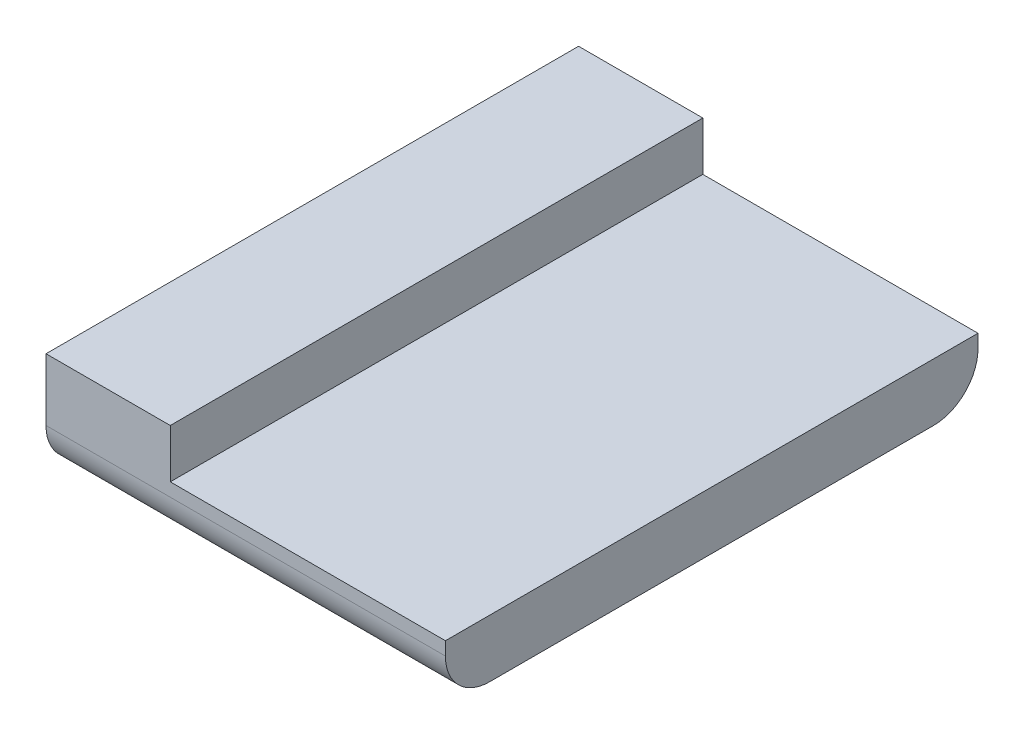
ISO-10303-21;
HEADER;
FILE_DESCRIPTION(('STEP AP214'),'2;1');
FILE_NAME('part.step','',(''),(''),'','','');
FILE_SCHEMA(('AUTOMOTIVE_DESIGN { 1 0 10303 214 1 1 1 1 }'));
ENDSEC;
DATA;
#1=APPLICATION_CONTEXT('core data for automotive mechanical design processes');
#2=APPLICATION_PROTOCOL_DEFINITION('international standard','automotive_design',2000,#1);
#3=PRODUCT_CONTEXT('',#1,'mechanical');
#4=PRODUCT('Part','Part','',(#3));
#5=PRODUCT_RELATED_PRODUCT_CATEGORY('part','',(#4));
#6=PRODUCT_DEFINITION_FORMATION('','',#4);
#7=PRODUCT_DEFINITION_CONTEXT('part definition',#1,'design');
#8=PRODUCT_DEFINITION('design','',#6,#7);
#9=PRODUCT_DEFINITION_SHAPE('','',#8);
#10=(LENGTH_UNIT() NAMED_UNIT(*) SI_UNIT(.MILLI.,.METRE.));
#11=(NAMED_UNIT(*) PLANE_ANGLE_UNIT() SI_UNIT($,.RADIAN.));
#12=(NAMED_UNIT(*) SI_UNIT($,.STERADIAN.) SOLID_ANGLE_UNIT());
#13=UNCERTAINTY_MEASURE_WITH_UNIT(LENGTH_MEASURE(1.E-05),#10,'distance_accuracy_value','');
#14=(GEOMETRIC_REPRESENTATION_CONTEXT(3) GLOBAL_UNCERTAINTY_ASSIGNED_CONTEXT((#13)) GLOBAL_UNIT_ASSIGNED_CONTEXT((#10,
#11,#12)) REPRESENTATION_CONTEXT('',''));
#15=CARTESIAN_POINT('',(0.,0.,0.));
#16=DIRECTION('',(0.,0.,1.));
#17=DIRECTION('',(1.,0.,0.));
#18=AXIS2_PLACEMENT_3D('',#15,#16,#17);
#19=CARTESIAN_POINT('',(0.,0.,60.));
#20=DIRECTION('',(1.,0.,0.));
#21=DIRECTION('',(0.,1.,0.));
#22=AXIS2_PLACEMENT_3D('',#19,#20,#21);
#23=PLANE('',#22);
#24=DIRECTION('',(0.,0.,-1.));
#25=VECTOR('',#24,1.);
#26=CARTESIAN_POINT('',(0.,-12.,60.));
#27=LINE('',#26,#25);
#28=CARTESIAN_POINT('',(0.,-12.,55.));
#29=VERTEX_POINT('',#28);
#30=CARTESIAN_POINT('',(0.,-12.,5.));
#31=VERTEX_POINT('',#30);
#32=EDGE_CURVE('E148',#29,#31,#27,.T.);
#33=ORIENTED_EDGE('',*,*,#32,.F.);
#34=CARTESIAN_POINT('',(0.,-7.,55.));
#35=DIRECTION('',(1.,0.,0.));
#36=DIRECTION('',(0.,1.,0.));
#37=AXIS2_PLACEMENT_3D('',#34,#35,#36);
#38=CIRCLE('',#37,5.);
#39=CARTESIAN_POINT('',(0.,-7.,60.));
#40=VERTEX_POINT('',#39);
#41=EDGE_CURVE('E41',#29,#40,#38,.F.);
#42=ORIENTED_EDGE('',*,*,#41,.T.);
#43=DIRECTION('',(0.,-1.,0.));
#44=VECTOR('',#43,1.);
#45=CARTESIAN_POINT('',(0.,0.,60.));
#46=LINE('',#45,#44);
#47=CARTESIAN_POINT('',(0.,0.,60.));
#48=VERTEX_POINT('',#47);
#49=EDGE_CURVE('E109',#48,#40,#46,.T.);
#50=ORIENTED_EDGE('',*,*,#49,.F.);
#51=DIRECTION('',(0.,0.,-1.));
#52=VECTOR('',#51,1.);
#53=CARTESIAN_POINT('',(0.,0.,60.));
#54=LINE('',#53,#52);
#55=CARTESIAN_POINT('',(0.,0.,0.));
#56=VERTEX_POINT('',#55);
#57=EDGE_CURVE('E130',#48,#56,#54,.T.);
#58=ORIENTED_EDGE('',*,*,#57,.T.);
#59=DIRECTION('',(0.,-1.,0.));
#60=VECTOR('',#59,1.);
#61=CARTESIAN_POINT('',(0.,0.,0.));
#62=LINE('',#61,#60);
#63=CARTESIAN_POINT('',(0.,-7.,0.));
#64=VERTEX_POINT('',#63);
#65=EDGE_CURVE('E131',#56,#64,#62,.T.);
#66=ORIENTED_EDGE('',*,*,#65,.T.);
#67=CARTESIAN_POINT('',(0.,-7.,5.));
#68=DIRECTION('',(1.,0.,0.));
#69=DIRECTION('',(0.,1.,0.));
#70=AXIS2_PLACEMENT_3D('',#67,#68,#69);
#71=CIRCLE('',#70,5.);
#72=EDGE_CURVE('E53',#64,#31,#71,.F.);
#73=ORIENTED_EDGE('',*,*,#72,.T.);
#74=EDGE_LOOP('',(#33,#42,#50,#58,#66,#73));
#75=FACE_BOUND('',#74,.T.);
#76=ADVANCED_FACE('F33',(#75),#23,.F.);
#77=CARTESIAN_POINT('',(0.,-12.,60.));
#78=DIRECTION('',(0.,1.,0.));
#79=DIRECTION('',(0.,0.,1.));
#80=AXIS2_PLACEMENT_3D('',#77,#78,#79);
#81=PLANE('',#80);
#82=DIRECTION('',(0.,0.,-1.));
#83=VECTOR('',#82,1.);
#84=CARTESIAN_POINT('',(45.,-12.,60.));
#85=LINE('',#84,#83);
#86=CARTESIAN_POINT('',(45.,-12.,55.));
#87=VERTEX_POINT('',#86);
#88=CARTESIAN_POINT('',(45.,-12.,5.));
#89=VERTEX_POINT('',#88);
#90=EDGE_CURVE('E117',#87,#89,#85,.T.);
#91=ORIENTED_EDGE('',*,*,#90,.F.);
#92=DIRECTION('',(1.,0.,0.));
#93=VECTOR('',#92,1.);
#94=CARTESIAN_POINT('',(0.,-12.,55.));
#95=LINE('',#94,#93);
#96=EDGE_CURVE('E158',#87,#29,#95,.F.);
#97=ORIENTED_EDGE('',*,*,#96,.T.);
#98=ORIENTED_EDGE('',*,*,#32,.T.);
#99=DIRECTION('',(1.,0.,0.));
#100=VECTOR('',#99,1.);
#101=CARTESIAN_POINT('',(0.,-12.,5.));
#102=LINE('',#101,#100);
#103=EDGE_CURVE('E155',#31,#89,#102,.T.);
#104=ORIENTED_EDGE('',*,*,#103,.T.);
#105=EDGE_LOOP('',(#91,#97,#98,#104));
#106=FACE_BOUND('',#105,.T.);
#107=ADVANCED_FACE('F169',(#106),#81,.F.);
#108=CARTESIAN_POINT('',(45.,-5.5,60.));
#109=DIRECTION('',(-1.,0.,0.));
#110=DIRECTION('',(0.,0.,1.));
#111=AXIS2_PLACEMENT_3D('',#108,#109,#110);
#112=PLANE('',#111);
#113=DIRECTION('',(0.,1.,0.));
#114=VECTOR('',#113,1.);
#115=CARTESIAN_POINT('',(45.,-5.5,60.));
#116=LINE('',#115,#114);
#117=CARTESIAN_POINT('',(45.,-7.,60.));
#118=VERTEX_POINT('',#117);
#119=CARTESIAN_POINT('',(45.,-5.5,60.));
#120=VERTEX_POINT('',#119);
#121=EDGE_CURVE('E99',#118,#120,#116,.T.);
#122=ORIENTED_EDGE('',*,*,#121,.F.);
#123=CARTESIAN_POINT('',(45.,-7.,55.));
#124=DIRECTION('',(-1.,0.,0.));
#125=DIRECTION('',(0.,0.,1.));
#126=AXIS2_PLACEMENT_3D('',#123,#124,#125);
#127=CIRCLE('',#126,5.);
#128=EDGE_CURVE('E153',#118,#87,#127,.F.);
#129=ORIENTED_EDGE('',*,*,#128,.T.);
#130=ORIENTED_EDGE('',*,*,#90,.T.);
#131=CARTESIAN_POINT('',(45.,-7.,5.));
#132=DIRECTION('',(-1.,0.,0.));
#133=DIRECTION('',(0.,0.,1.));
#134=AXIS2_PLACEMENT_3D('',#131,#132,#133);
#135=CIRCLE('',#134,5.);
#136=CARTESIAN_POINT('',(45.,-7.,0.));
#137=VERTEX_POINT('',#136);
#138=EDGE_CURVE('E151',#89,#137,#135,.F.);
#139=ORIENTED_EDGE('',*,*,#138,.T.);
#140=DIRECTION('',(0.,1.,0.));
#141=VECTOR('',#140,1.);
#142=CARTESIAN_POINT('',(45.,-5.5,0.));
#143=LINE('',#142,#141);
#144=CARTESIAN_POINT('',(45.,-5.5,0.));
#145=VERTEX_POINT('',#144);
#146=EDGE_CURVE('E114',#137,#145,#143,.T.);
#147=ORIENTED_EDGE('',*,*,#146,.T.);
#148=DIRECTION('',(0.,0.,-1.));
#149=VECTOR('',#148,1.);
#150=CARTESIAN_POINT('',(45.,-5.5,60.));
#151=LINE('',#150,#149);
#152=EDGE_CURVE('E112',#120,#145,#151,.T.);
#153=ORIENTED_EDGE('',*,*,#152,.F.);
#154=EDGE_LOOP('',(#122,#129,#130,#139,#147,#153));
#155=FACE_BOUND('',#154,.T.);
#156=ADVANCED_FACE('F113',(#155),#112,.F.);
#157=CARTESIAN_POINT('',(14.,-5.5,60.));
#158=DIRECTION('',(0.,-1.,0.));
#159=DIRECTION('',(0.,0.,-1.));
#160=AXIS2_PLACEMENT_3D('',#157,#158,#159);
#161=PLANE('',#160);
#162=DIRECTION('',(-1.,0.,0.));
#163=VECTOR('',#162,1.);
#164=CARTESIAN_POINT('',(14.,-5.5,0.));
#165=LINE('',#164,#163);
#166=CARTESIAN_POINT('',(14.,-5.5,0.));
#167=VERTEX_POINT('',#166);
#168=EDGE_CURVE('E134',#145,#167,#165,.T.);
#169=ORIENTED_EDGE('',*,*,#168,.T.);
#170=DIRECTION('',(0.,0.,-1.));
#171=VECTOR('',#170,1.);
#172=CARTESIAN_POINT('',(14.,-5.5,60.));
#173=LINE('',#172,#171);
#174=CARTESIAN_POINT('',(14.,-5.5,60.));
#175=VERTEX_POINT('',#174);
#176=EDGE_CURVE('E118',#175,#167,#173,.T.);
#177=ORIENTED_EDGE('',*,*,#176,.F.);
#178=DIRECTION('',(-1.,0.,0.));
#179=VECTOR('',#178,1.);
#180=CARTESIAN_POINT('',(14.,-5.5,60.));
#181=LINE('',#180,#179);
#182=EDGE_CURVE('E104',#120,#175,#181,.T.);
#183=ORIENTED_EDGE('',*,*,#182,.F.);
#184=ORIENTED_EDGE('',*,*,#152,.T.);
#185=EDGE_LOOP('',(#169,#177,#183,#184));
#186=FACE_BOUND('',#185,.T.);
#187=ADVANCED_FACE('F120',(#186),#161,.F.);
#188=CARTESIAN_POINT('',(14.,0.,60.));
#189=DIRECTION('',(-1.,0.,0.));
#190=DIRECTION('',(0.,0.,1.));
#191=AXIS2_PLACEMENT_3D('',#188,#189,#190);
#192=PLANE('',#191);
#193=DIRECTION('',(0.,1.,0.));
#194=VECTOR('',#193,1.);
#195=CARTESIAN_POINT('',(14.,0.,0.));
#196=LINE('',#195,#194);
#197=CARTESIAN_POINT('',(14.,0.,0.));
#198=VERTEX_POINT('',#197);
#199=EDGE_CURVE('E136',#167,#198,#196,.T.);
#200=ORIENTED_EDGE('',*,*,#199,.T.);
#201=DIRECTION('',(0.,0.,-1.));
#202=VECTOR('',#201,1.);
#203=CARTESIAN_POINT('',(14.,0.,60.));
#204=LINE('',#203,#202);
#205=CARTESIAN_POINT('',(14.,0.,60.));
#206=VERTEX_POINT('',#205);
#207=EDGE_CURVE('E142',#206,#198,#204,.T.);
#208=ORIENTED_EDGE('',*,*,#207,.F.);
#209=DIRECTION('',(0.,1.,0.));
#210=VECTOR('',#209,1.);
#211=CARTESIAN_POINT('',(14.,0.,60.));
#212=LINE('',#211,#210);
#213=EDGE_CURVE('E123',#175,#206,#212,.T.);
#214=ORIENTED_EDGE('',*,*,#213,.F.);
#215=ORIENTED_EDGE('',*,*,#176,.T.);
#216=EDGE_LOOP('',(#200,#208,#214,#215));
#217=FACE_BOUND('',#216,.T.);
#218=ADVANCED_FACE('F176',(#217),#192,.F.);
#219=CARTESIAN_POINT('',(0.,0.,60.));
#220=DIRECTION('',(0.,-1.,0.));
#221=DIRECTION('',(0.,0.,-1.));
#222=AXIS2_PLACEMENT_3D('',#219,#220,#221);
#223=PLANE('',#222);
#224=DIRECTION('',(-1.,0.,0.));
#225=VECTOR('',#224,1.);
#226=CARTESIAN_POINT('',(0.,0.,0.));
#227=LINE('',#226,#225);
#228=EDGE_CURVE('E138',#198,#56,#227,.T.);
#229=ORIENTED_EDGE('',*,*,#228,.T.);
#230=ORIENTED_EDGE('',*,*,#57,.F.);
#231=DIRECTION('',(-1.,0.,0.));
#232=VECTOR('',#231,1.);
#233=CARTESIAN_POINT('',(0.,0.,60.));
#234=LINE('',#233,#232);
#235=EDGE_CURVE('E125',#206,#48,#234,.T.);
#236=ORIENTED_EDGE('',*,*,#235,.F.);
#237=ORIENTED_EDGE('',*,*,#207,.T.);
#238=EDGE_LOOP('',(#229,#230,#236,#237));
#239=FACE_BOUND('',#238,.T.);
#240=ADVANCED_FACE('F179',(#239),#223,.F.);
#241=CARTESIAN_POINT('',(0.,-12.,60.));
#242=DIRECTION('',(0.,0.,1.));
#243=DIRECTION('',(1.,0.,0.));
#244=AXIS2_PLACEMENT_3D('',#241,#242,#243);
#245=PLANE('',#244);
#246=ORIENTED_EDGE('',*,*,#49,.T.);
#247=DIRECTION('',(1.,0.,0.));
#248=VECTOR('',#247,1.);
#249=CARTESIAN_POINT('',(45.,-7.,60.));
#250=LINE('',#249,#248);
#251=EDGE_CURVE('E107',#40,#118,#250,.T.);
#252=ORIENTED_EDGE('',*,*,#251,.T.);
#253=ORIENTED_EDGE('',*,*,#121,.T.);
#254=ORIENTED_EDGE('',*,*,#182,.T.);
#255=ORIENTED_EDGE('',*,*,#213,.T.);
#256=ORIENTED_EDGE('',*,*,#235,.T.);
#257=EDGE_LOOP('',(#246,#252,#253,#254,#255,#256));
#258=FACE_BOUND('',#257,.T.);
#259=ADVANCED_FACE('F102',(#258),#245,.T.);
#260=CARTESIAN_POINT('',(0.,-12.,0.));
#261=DIRECTION('',(0.,0.,1.));
#262=DIRECTION('',(1.,0.,0.));
#263=AXIS2_PLACEMENT_3D('',#260,#261,#262);
#264=PLANE('',#263);
#265=ORIENTED_EDGE('',*,*,#146,.F.);
#266=DIRECTION('',(1.,0.,0.));
#267=VECTOR('',#266,1.);
#268=CARTESIAN_POINT('',(0.,-7.,0.));
#269=LINE('',#268,#267);
#270=EDGE_CURVE('E11',#137,#64,#269,.F.);
#271=ORIENTED_EDGE('',*,*,#270,.T.);
#272=ORIENTED_EDGE('',*,*,#65,.F.);
#273=ORIENTED_EDGE('',*,*,#228,.F.);
#274=ORIENTED_EDGE('',*,*,#199,.F.);
#275=ORIENTED_EDGE('',*,*,#168,.F.);
#276=EDGE_LOOP('',(#265,#271,#272,#273,#274,#275));
#277=FACE_BOUND('',#276,.T.);
#278=ADVANCED_FACE('F172',(#277),#264,.F.);
#279=CARTESIAN_POINT('',(0.,-7.,55.));
#280=DIRECTION('',(-1.,0.,0.));
#281=DIRECTION('',(0.,0.,1.));
#282=AXIS2_PLACEMENT_3D('',#279,#280,#281);
#283=CYLINDRICAL_SURFACE('',#282,5.);
#284=ORIENTED_EDGE('',*,*,#41,.F.);
#285=ORIENTED_EDGE('',*,*,#96,.F.);
#286=ORIENTED_EDGE('',*,*,#128,.F.);
#287=ORIENTED_EDGE('',*,*,#251,.F.);
#288=EDGE_LOOP('',(#284,#285,#286,#287));
#289=FACE_BOUND('',#288,.T.);
#290=ADVANCED_FACE('F166',(#289),#283,.T.);
#291=CARTESIAN_POINT('',(0.,-7.,5.));
#292=DIRECTION('',(1.,0.,0.));
#293=DIRECTION('',(0.,0.,-1.));
#294=AXIS2_PLACEMENT_3D('',#291,#292,#293);
#295=CYLINDRICAL_SURFACE('',#294,5.);
#296=ORIENTED_EDGE('',*,*,#72,.F.);
#297=ORIENTED_EDGE('',*,*,#270,.F.);
#298=ORIENTED_EDGE('',*,*,#138,.F.);
#299=ORIENTED_EDGE('',*,*,#103,.F.);
#300=EDGE_LOOP('',(#296,#297,#298,#299));
#301=FACE_BOUND('',#300,.T.);
#302=ADVANCED_FACE('F35',(#301),#295,.T.);
#303=CLOSED_SHELL('',(#76,#107,#156,#187,#218,#240,#259,#278,#290,#302));
#304=MANIFOLD_SOLID_BREP('B2',#303);
#305=ADVANCED_BREP_SHAPE_REPRESENTATION('',(#18,#304),#14);
#306=SHAPE_DEFINITION_REPRESENTATION(#9,#305);
ENDSEC;
END-ISO-10303-21;
